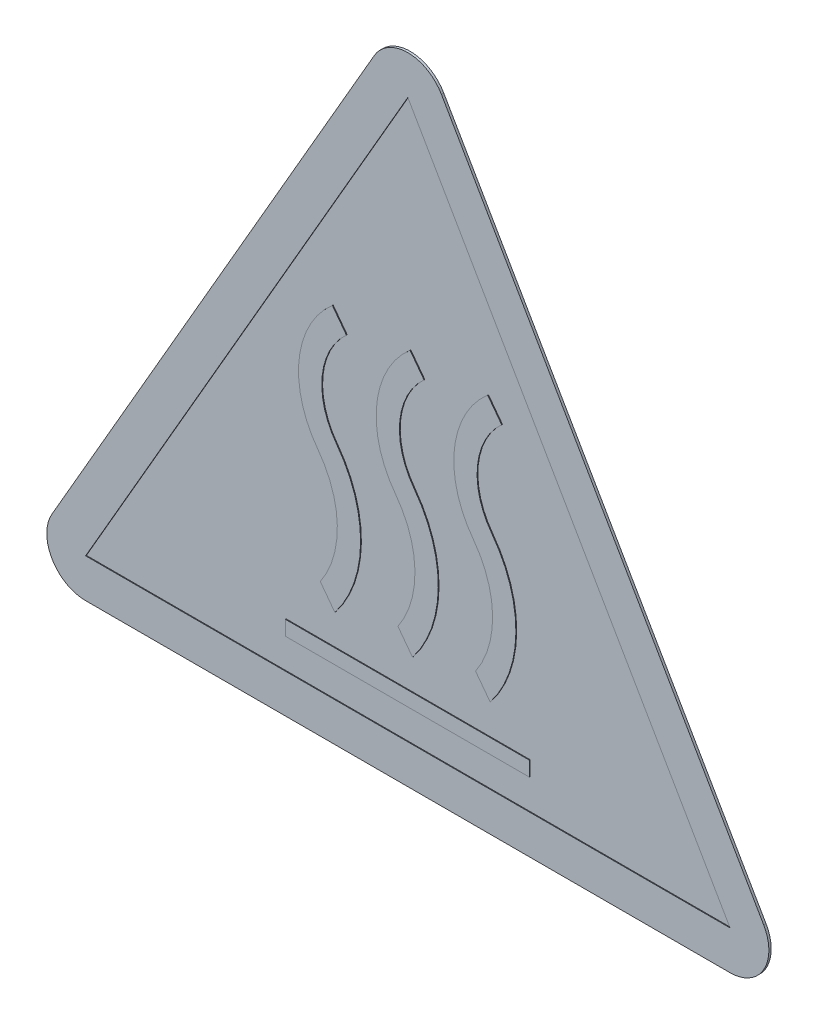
ISO-10303-21;
HEADER;
FILE_DESCRIPTION(('STEP AP214'),'2;1');
FILE_NAME('part.step','',(''),(''),'','','');
FILE_SCHEMA(('AUTOMOTIVE_DESIGN { 1 0 10303 214 1 1 1 1 }'));
ENDSEC;
DATA;
#1=APPLICATION_CONTEXT('core data for automotive mechanical design processes');
#2=APPLICATION_PROTOCOL_DEFINITION('international standard','automotive_design',2000,#1);
#3=PRODUCT_CONTEXT('',#1,'mechanical');
#4=PRODUCT('Part','Part','',(#3));
#5=PRODUCT_RELATED_PRODUCT_CATEGORY('part','',(#4));
#6=PRODUCT_DEFINITION_FORMATION('','',#4);
#7=PRODUCT_DEFINITION_CONTEXT('part definition',#1,'design');
#8=PRODUCT_DEFINITION('design','',#6,#7);
#9=PRODUCT_DEFINITION_SHAPE('','',#8);
#10=(LENGTH_UNIT() NAMED_UNIT(*) SI_UNIT(.MILLI.,.METRE.));
#11=(NAMED_UNIT(*) PLANE_ANGLE_UNIT() SI_UNIT($,.RADIAN.));
#12=(NAMED_UNIT(*) SI_UNIT($,.STERADIAN.) SOLID_ANGLE_UNIT());
#13=UNCERTAINTY_MEASURE_WITH_UNIT(LENGTH_MEASURE(1.E-05),#10,'distance_accuracy_value','');
#14=(GEOMETRIC_REPRESENTATION_CONTEXT(3) GLOBAL_UNCERTAINTY_ASSIGNED_CONTEXT((#13)) GLOBAL_UNIT_ASSIGNED_CONTEXT((#10,
#11,#12)) REPRESENTATION_CONTEXT('',''));
#15=CARTESIAN_POINT('',(0.,0.,0.));
#16=DIRECTION('',(0.,0.,1.));
#17=DIRECTION('',(1.,0.,0.));
#18=AXIS2_PLACEMENT_3D('',#15,#16,#17);
#19=CARTESIAN_POINT('',(0.,76.8801085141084,0.300000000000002));
#20=DIRECTION('',(0.,0.,-1.));
#21=DIRECTION('',(-1.,0.,0.));
#22=AXIS2_PLACEMENT_3D('',#19,#20,#21);
#23=CYLINDRICAL_SURFACE('',#22,5.);
#24=CARTESIAN_POINT('',(0.,76.8801085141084,0.));
#25=DIRECTION('',(0.,0.,1.));
#26=DIRECTION('',(1.,0.,0.));
#27=AXIS2_PLACEMENT_3D('',#24,#25,#26);
#28=CIRCLE('',#27,5.);
#29=CARTESIAN_POINT('',(4.33012701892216,79.3801085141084,0.));
#30=VERTEX_POINT('',#29);
#31=CARTESIAN_POINT('',(-4.33012701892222,79.3801085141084,0.));
#32=VERTEX_POINT('',#31);
#33=EDGE_CURVE('E522',#30,#32,#28,.T.);
#34=ORIENTED_EDGE('',*,*,#33,.T.);
#35=DIRECTION('',(0.,0.,-1.));
#36=VECTOR('',#35,1.);
#37=CARTESIAN_POINT('',(-4.33012701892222,79.3801085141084,0.300000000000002));
#38=LINE('',#37,#36);
#39=CARTESIAN_POINT('',(-4.33012701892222,79.3801085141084,0.300000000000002));
#40=VERTEX_POINT('',#39);
#41=EDGE_CURVE('E11',#40,#32,#38,.T.);
#42=ORIENTED_EDGE('',*,*,#41,.F.);
#43=CARTESIAN_POINT('',(0.,76.8801085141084,0.300000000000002));
#44=DIRECTION('',(0.,0.,1.));
#45=DIRECTION('',(1.,0.,0.));
#46=AXIS2_PLACEMENT_3D('',#43,#44,#45);
#47=CIRCLE('',#46,5.);
#48=CARTESIAN_POINT('',(4.33012701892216,79.3801085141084,0.300000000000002));
#49=VERTEX_POINT('',#48);
#50=EDGE_CURVE('E546',#49,#40,#47,.T.);
#51=ORIENTED_EDGE('',*,*,#50,.F.);
#52=DIRECTION('',(0.,0.,-1.));
#53=VECTOR('',#52,1.);
#54=CARTESIAN_POINT('',(4.33012701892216,79.3801085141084,0.300000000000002));
#55=LINE('',#54,#53);
#56=EDGE_CURVE('E564',#49,#30,#55,.T.);
#57=ORIENTED_EDGE('',*,*,#56,.T.);
#58=EDGE_LOOP('',(#34,#42,#51,#57));
#59=FACE_BOUND('',#58,.T.);
#60=ADVANCED_FACE('F40',(#59),#23,.T.);
#61=CARTESIAN_POINT('',(-4.33012701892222,79.3801085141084,0.300000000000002));
#62=DIRECTION('',(0.866025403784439,-0.5,0.));
#63=DIRECTION('',(0.5,0.866025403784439,0.));
#64=AXIS2_PLACEMENT_3D('',#61,#62,#63);
#65=PLANE('',#64);
#66=DIRECTION('',(-0.5,-0.866025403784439,0.));
#67=VECTOR('',#66,1.);
#68=CARTESIAN_POINT('',(-4.33012701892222,79.3801085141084,0.));
#69=LINE('',#68,#67);
#70=CARTESIAN_POINT('',(-45.8301270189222,7.50000000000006,0.));
#71=VERTEX_POINT('',#70);
#72=EDGE_CURVE('E531',#32,#71,#69,.T.);
#73=ORIENTED_EDGE('',*,*,#72,.T.);
#74=DIRECTION('',(0.,0.,-1.));
#75=VECTOR('',#74,1.);
#76=CARTESIAN_POINT('',(-45.8301270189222,7.50000000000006,0.300000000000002));
#77=LINE('',#76,#75);
#78=CARTESIAN_POINT('',(-45.8301270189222,7.50000000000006,0.300000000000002));
#79=VERTEX_POINT('',#78);
#80=EDGE_CURVE('E48',#79,#71,#77,.T.);
#81=ORIENTED_EDGE('',*,*,#80,.F.);
#82=DIRECTION('',(-0.5,-0.866025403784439,0.));
#83=VECTOR('',#82,1.);
#84=CARTESIAN_POINT('',(-4.33012701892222,79.3801085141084,0.300000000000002));
#85=LINE('',#84,#83);
#86=EDGE_CURVE('E550',#40,#79,#85,.T.);
#87=ORIENTED_EDGE('',*,*,#86,.F.);
#88=ORIENTED_EDGE('',*,*,#41,.T.);
#89=EDGE_LOOP('',(#73,#81,#87,#88));
#90=FACE_BOUND('',#89,.T.);
#91=ADVANCED_FACE('F608',(#90),#65,.F.);
#92=CARTESIAN_POINT('',(-41.5,5.00000000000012,0.300000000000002));
#93=DIRECTION('',(0.,0.,-1.));
#94=DIRECTION('',(-1.,0.,0.));
#95=AXIS2_PLACEMENT_3D('',#92,#93,#94);
#96=CYLINDRICAL_SURFACE('',#95,5.);
#97=CARTESIAN_POINT('',(-41.5,5.00000000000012,0.));
#98=DIRECTION('',(0.,0.,1.));
#99=DIRECTION('',(-1.,0.,0.));
#100=AXIS2_PLACEMENT_3D('',#97,#98,#99);
#101=CIRCLE('',#100,5.);
#102=CARTESIAN_POINT('',(-41.5,0.,0.));
#103=VERTEX_POINT('',#102);
#104=EDGE_CURVE('E534',#71,#103,#101,.T.);
#105=ORIENTED_EDGE('',*,*,#104,.T.);
#106=DIRECTION('',(0.,0.,-1.));
#107=VECTOR('',#106,1.);
#108=CARTESIAN_POINT('',(-41.5,0.,0.300000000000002));
#109=LINE('',#108,#107);
#110=CARTESIAN_POINT('',(-41.5,0.,0.300000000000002));
#111=VERTEX_POINT('',#110);
#112=EDGE_CURVE('E576',#111,#103,#109,.T.);
#113=ORIENTED_EDGE('',*,*,#112,.F.);
#114=CARTESIAN_POINT('',(-41.5,5.00000000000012,0.300000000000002));
#115=DIRECTION('',(0.,0.,1.));
#116=DIRECTION('',(-1.,0.,0.));
#117=AXIS2_PLACEMENT_3D('',#114,#115,#116);
#118=CIRCLE('',#117,5.);
#119=EDGE_CURVE('E553',#79,#111,#118,.T.);
#120=ORIENTED_EDGE('',*,*,#119,.F.);
#121=ORIENTED_EDGE('',*,*,#80,.T.);
#122=EDGE_LOOP('',(#105,#113,#120,#121));
#123=FACE_BOUND('',#122,.T.);
#124=ADVANCED_FACE('F585',(#123),#96,.T.);
#125=CARTESIAN_POINT('',(-41.5,0.,0.300000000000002));
#126=DIRECTION('',(0.,1.,0.));
#127=DIRECTION('',(-1.,0.,0.));
#128=AXIS2_PLACEMENT_3D('',#125,#126,#127);
#129=PLANE('',#128);
#130=DIRECTION('',(1.,0.,0.));
#131=VECTOR('',#130,1.);
#132=CARTESIAN_POINT('',(-41.5,0.,0.));
#133=LINE('',#132,#131);
#134=CARTESIAN_POINT('',(41.5,0.,0.));
#135=VERTEX_POINT('',#134);
#136=EDGE_CURVE('E537',#103,#135,#133,.T.);
#137=ORIENTED_EDGE('',*,*,#136,.T.);
#138=DIRECTION('',(0.,0.,-1.));
#139=VECTOR('',#138,1.);
#140=CARTESIAN_POINT('',(41.5,0.,0.300000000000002));
#141=LINE('',#140,#139);
#142=CARTESIAN_POINT('',(41.5,0.,0.300000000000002));
#143=VERTEX_POINT('',#142);
#144=EDGE_CURVE('E572',#143,#135,#141,.T.);
#145=ORIENTED_EDGE('',*,*,#144,.F.);
#146=DIRECTION('',(1.,0.,0.));
#147=VECTOR('',#146,1.);
#148=CARTESIAN_POINT('',(-41.5,0.,0.300000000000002));
#149=LINE('',#148,#147);
#150=EDGE_CURVE('E556',#111,#143,#149,.T.);
#151=ORIENTED_EDGE('',*,*,#150,.F.);
#152=ORIENTED_EDGE('',*,*,#112,.T.);
#153=EDGE_LOOP('',(#137,#145,#151,#152));
#154=FACE_BOUND('',#153,.T.);
#155=ADVANCED_FACE('F596',(#154),#129,.F.);
#156=CARTESIAN_POINT('',(41.5,5.00000000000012,0.300000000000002));
#157=DIRECTION('',(0.,0.,-1.));
#158=DIRECTION('',(-1.,0.,0.));
#159=AXIS2_PLACEMENT_3D('',#156,#157,#158);
#160=CYLINDRICAL_SURFACE('',#159,5.);
#161=CARTESIAN_POINT('',(41.5,5.00000000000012,0.));
#162=DIRECTION('',(0.,0.,1.));
#163=DIRECTION('',(1.,0.,0.));
#164=AXIS2_PLACEMENT_3D('',#161,#162,#163);
#165=CIRCLE('',#164,5.);
#166=CARTESIAN_POINT('',(45.8301270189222,7.50000000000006,0.));
#167=VERTEX_POINT('',#166);
#168=EDGE_CURVE('E540',#135,#167,#165,.T.);
#169=ORIENTED_EDGE('',*,*,#168,.T.);
#170=DIRECTION('',(0.,0.,-1.));
#171=VECTOR('',#170,1.);
#172=CARTESIAN_POINT('',(45.8301270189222,7.50000000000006,0.300000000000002));
#173=LINE('',#172,#171);
#174=CARTESIAN_POINT('',(45.8301270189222,7.50000000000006,0.300000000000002));
#175=VERTEX_POINT('',#174);
#176=EDGE_CURVE('E568',#175,#167,#173,.T.);
#177=ORIENTED_EDGE('',*,*,#176,.F.);
#178=CARTESIAN_POINT('',(41.5,5.00000000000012,0.300000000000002));
#179=DIRECTION('',(0.,0.,1.));
#180=DIRECTION('',(1.,0.,0.));
#181=AXIS2_PLACEMENT_3D('',#178,#179,#180);
#182=CIRCLE('',#181,5.);
#183=EDGE_CURVE('E558',#143,#175,#182,.T.);
#184=ORIENTED_EDGE('',*,*,#183,.F.);
#185=ORIENTED_EDGE('',*,*,#144,.T.);
#186=EDGE_LOOP('',(#169,#177,#184,#185));
#187=FACE_BOUND('',#186,.T.);
#188=ADVANCED_FACE('F600',(#187),#160,.T.);
#189=CARTESIAN_POINT('',(45.8301270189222,7.50000000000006,0.300000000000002));
#190=DIRECTION('',(-0.866025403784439,-0.5,0.));
#191=DIRECTION('',(0.5,-0.866025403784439,0.));
#192=AXIS2_PLACEMENT_3D('',#189,#190,#191);
#193=PLANE('',#192);
#194=DIRECTION('',(-0.5,0.866025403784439,0.));
#195=VECTOR('',#194,1.);
#196=CARTESIAN_POINT('',(45.8301270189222,7.50000000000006,0.));
#197=LINE('',#196,#195);
#198=EDGE_CURVE('E543',#167,#30,#197,.T.);
#199=ORIENTED_EDGE('',*,*,#198,.T.);
#200=ORIENTED_EDGE('',*,*,#56,.F.);
#201=DIRECTION('',(-0.5,0.866025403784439,0.));
#202=VECTOR('',#201,1.);
#203=CARTESIAN_POINT('',(45.8301270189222,7.50000000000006,0.300000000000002));
#204=LINE('',#203,#202);
#205=EDGE_CURVE('E561',#175,#49,#204,.T.);
#206=ORIENTED_EDGE('',*,*,#205,.F.);
#207=ORIENTED_EDGE('',*,*,#176,.T.);
#208=EDGE_LOOP('',(#199,#200,#206,#207));
#209=FACE_BOUND('',#208,.T.);
#210=ADVANCED_FACE('F611',(#209),#193,.F.);
#211=CARTESIAN_POINT('',(0.,76.8801085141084,0.300000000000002));
#212=DIRECTION('',(0.,0.,1.));
#213=DIRECTION('',(1.,0.,0.));
#214=AXIS2_PLACEMENT_3D('',#211,#212,#213);
#215=PLANE('',#214);
#216=DIRECTION('',(-0.5,0.866025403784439,0.));
#217=VECTOR('',#216,1.);
#218=CARTESIAN_POINT('',(41.5,5.00000000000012,0.300000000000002));
#219=LINE('',#218,#217);
#220=CARTESIAN_POINT('',(41.5,5.00000000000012,0.300000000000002));
#221=VERTEX_POINT('',#220);
#222=CARTESIAN_POINT('',(0.,76.8801085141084,0.300000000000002));
#223=VERTEX_POINT('',#222);
#224=EDGE_CURVE('E55',#221,#223,#219,.T.);
#225=ORIENTED_EDGE('',*,*,#224,.F.);
#226=DIRECTION('',(1.,0.,0.));
#227=VECTOR('',#226,1.);
#228=CARTESIAN_POINT('',(-41.5,5.00000000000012,0.300000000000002));
#229=LINE('',#228,#227);
#230=CARTESIAN_POINT('',(-41.5,5.00000000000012,0.300000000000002));
#231=VERTEX_POINT('',#230);
#232=EDGE_CURVE('E502',#231,#221,#229,.T.);
#233=ORIENTED_EDGE('',*,*,#232,.F.);
#234=DIRECTION('',(-0.5,-0.866025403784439,0.));
#235=VECTOR('',#234,1.);
#236=CARTESIAN_POINT('',(0.,76.8801085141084,0.300000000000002));
#237=LINE('',#236,#235);
#238=EDGE_CURVE('E498',#223,#231,#237,.T.);
#239=ORIENTED_EDGE('',*,*,#238,.F.);
#240=EDGE_LOOP('',(#225,#233,#239));
#241=FACE_BOUND('',#240,.T.);
#242=ORIENTED_EDGE('',*,*,#50,.T.);
#243=ORIENTED_EDGE('',*,*,#86,.T.);
#244=ORIENTED_EDGE('',*,*,#119,.T.);
#245=ORIENTED_EDGE('',*,*,#150,.T.);
#246=ORIENTED_EDGE('',*,*,#183,.T.);
#247=ORIENTED_EDGE('',*,*,#205,.T.);
#248=EDGE_LOOP('',(#242,#243,#244,#245,#246,#247));
#249=FACE_BOUND('',#248,.T.);
#250=ADVANCED_FACE('F604',(#241,#249),#215,.T.);
#251=CARTESIAN_POINT('',(0.,76.8801085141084,0.));
#252=DIRECTION('',(0.,0.,1.));
#253=DIRECTION('',(1.,0.,0.));
#254=AXIS2_PLACEMENT_3D('',#251,#252,#253);
#255=PLANE('',#254);
#256=ORIENTED_EDGE('',*,*,#33,.F.);
#257=ORIENTED_EDGE('',*,*,#198,.F.);
#258=ORIENTED_EDGE('',*,*,#168,.F.);
#259=ORIENTED_EDGE('',*,*,#136,.F.);
#260=ORIENTED_EDGE('',*,*,#104,.F.);
#261=ORIENTED_EDGE('',*,*,#72,.F.);
#262=EDGE_LOOP('',(#256,#257,#258,#259,#260,#261));
#263=FACE_BOUND('',#262,.T.);
#264=ADVANCED_FACE('F591',(#263),#255,.F.);
#265=CARTESIAN_POINT('',(41.5,5.00000000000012,0.199999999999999));
#266=DIRECTION('',(0.866025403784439,0.5,0.));
#267=DIRECTION('',(-0.5,0.866025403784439,0.));
#268=AXIS2_PLACEMENT_3D('',#265,#266,#267);
#269=PLANE('',#268);
#270=ORIENTED_EDGE('',*,*,#224,.T.);
#271=DIRECTION('',(0.,0.,1.));
#272=VECTOR('',#271,1.);
#273=CARTESIAN_POINT('',(0.,76.8801085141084,0.199999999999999));
#274=LINE('',#273,#272);
#275=CARTESIAN_POINT('',(0.,76.8801085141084,0.199999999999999));
#276=VERTEX_POINT('',#275);
#277=EDGE_CURVE('E518',#276,#223,#274,.T.);
#278=ORIENTED_EDGE('',*,*,#277,.F.);
#279=DIRECTION('',(-0.5,0.866025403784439,0.));
#280=VECTOR('',#279,1.);
#281=CARTESIAN_POINT('',(41.5,5.00000000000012,0.199999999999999));
#282=LINE('',#281,#280);
#283=CARTESIAN_POINT('',(41.5,5.00000000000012,0.199999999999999));
#284=VERTEX_POINT('',#283);
#285=EDGE_CURVE('E506',#284,#276,#282,.T.);
#286=ORIENTED_EDGE('',*,*,#285,.F.);
#287=DIRECTION('',(0.,0.,1.));
#288=VECTOR('',#287,1.);
#289=CARTESIAN_POINT('',(41.5,5.00000000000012,0.199999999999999));
#290=LINE('',#289,#288);
#291=EDGE_CURVE('E519',#284,#221,#290,.T.);
#292=ORIENTED_EDGE('',*,*,#291,.T.);
#293=EDGE_LOOP('',(#270,#278,#286,#292));
#294=FACE_BOUND('',#293,.T.);
#295=ADVANCED_FACE('F656',(#294),#269,.F.);
#296=CARTESIAN_POINT('',(-41.5,5.00000000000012,0.199999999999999));
#297=DIRECTION('',(0.,-1.,0.));
#298=DIRECTION('',(0.,0.,-1.));
#299=AXIS2_PLACEMENT_3D('',#296,#297,#298);
#300=PLANE('',#299);
#301=ORIENTED_EDGE('',*,*,#232,.T.);
#302=ORIENTED_EDGE('',*,*,#291,.F.);
#303=DIRECTION('',(1.,0.,0.));
#304=VECTOR('',#303,1.);
#305=CARTESIAN_POINT('',(-41.5,5.00000000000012,0.199999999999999));
#306=LINE('',#305,#304);
#307=CARTESIAN_POINT('',(-41.5,5.00000000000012,0.199999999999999));
#308=VERTEX_POINT('',#307);
#309=EDGE_CURVE('E514',#308,#284,#306,.T.);
#310=ORIENTED_EDGE('',*,*,#309,.F.);
#311=DIRECTION('',(0.,0.,1.));
#312=VECTOR('',#311,1.);
#313=CARTESIAN_POINT('',(-41.5,5.00000000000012,0.199999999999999));
#314=LINE('',#313,#312);
#315=EDGE_CURVE('E523',#308,#231,#314,.T.);
#316=ORIENTED_EDGE('',*,*,#315,.T.);
#317=EDGE_LOOP('',(#301,#302,#310,#316));
#318=FACE_BOUND('',#317,.T.);
#319=ADVANCED_FACE('F664',(#318),#300,.F.);
#320=CARTESIAN_POINT('',(0.,76.8801085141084,0.199999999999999));
#321=DIRECTION('',(-0.866025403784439,0.5,0.));
#322=DIRECTION('',(-0.5,-0.866025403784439,0.));
#323=AXIS2_PLACEMENT_3D('',#320,#321,#322);
#324=PLANE('',#323);
#325=ORIENTED_EDGE('',*,*,#238,.T.);
#326=ORIENTED_EDGE('',*,*,#315,.F.);
#327=DIRECTION('',(-0.5,-0.866025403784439,0.));
#328=VECTOR('',#327,1.);
#329=CARTESIAN_POINT('',(0.,76.8801085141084,0.199999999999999));
#330=LINE('',#329,#328);
#331=EDGE_CURVE('E510',#276,#308,#330,.T.);
#332=ORIENTED_EDGE('',*,*,#331,.F.);
#333=ORIENTED_EDGE('',*,*,#277,.T.);
#334=EDGE_LOOP('',(#325,#326,#332,#333));
#335=FACE_BOUND('',#334,.T.);
#336=ADVANCED_FACE('F672',(#335),#324,.F.);
#337=CARTESIAN_POINT('',(0.,76.8801085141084,0.199999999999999));
#338=DIRECTION('',(0.,0.,1.));
#339=DIRECTION('',(1.,0.,0.));
#340=AXIS2_PLACEMENT_3D('',#337,#338,#339);
#341=PLANE('',#340);
#342=CARTESIAN_POINT('',(-1.58108827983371,24.328772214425,0.199999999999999));
#343=DIRECTION('',(0.,0.,1.));
#344=DIRECTION('',(1.,0.,0.));
#345=AXIS2_PLACEMENT_3D('',#342,#343,#344);
#346=CIRCLE('',#345,15.5);
#347=CARTESIAN_POINT('',(10.60237841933,14.7468549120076,0.199999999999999));
#348=VERTEX_POINT('',#347);
#349=CARTESIAN_POINT('',(10.8189117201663,33.6287722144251,0.199999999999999));
#350=VERTEX_POINT('',#349);
#351=EDGE_CURVE('E304',#348,#350,#346,.T.);
#352=ORIENTED_EDGE('',*,*,#351,.F.);
#353=DIRECTION('',(0.6,-0.8,0.));
#354=VECTOR('',#353,1.);
#355=CARTESIAN_POINT('',(8.72312323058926,17.2525284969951,0.199999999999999));
#356=LINE('',#355,#354);
#357=CARTESIAN_POINT('',(8.72312323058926,17.2525284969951,0.199999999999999));
#358=VERTEX_POINT('',#357);
#359=EDGE_CURVE('E300',#358,#348,#356,.T.);
#360=ORIENTED_EDGE('',*,*,#359,.F.);
#361=CARTESIAN_POINT('',(-1.58108827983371,24.328772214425,0.199999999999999));
#362=DIRECTION('',(0.,0.,-1.));
#363=DIRECTION('',(1.,0.,0.));
#364=AXIS2_PLACEMENT_3D('',#361,#362,#363);
#365=CIRCLE('',#364,12.5);
#366=CARTESIAN_POINT('',(8.41891172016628,31.828772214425,0.199999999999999));
#367=VERTEX_POINT('',#366);
#368=EDGE_CURVE('E297',#367,#358,#365,.T.);
#369=ORIENTED_EDGE('',*,*,#368,.F.);
#370=CARTESIAN_POINT('',(18.4189117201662,39.3287722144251,0.199999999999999));
#371=DIRECTION('',(0.,0.,1.));
#372=DIRECTION('',(1.,0.,0.));
#373=AXIS2_PLACEMENT_3D('',#370,#371,#372);
#374=CIRCLE('',#373,12.5);
#375=CARTESIAN_POINT('',(10.2819801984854,48.8177313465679,0.199999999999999));
#376=VERTEX_POINT('',#375);
#377=EDGE_CURVE('E250',#376,#367,#374,.T.);
#378=ORIENTED_EDGE('',*,*,#377,.F.);
#379=DIRECTION('',(-0.600000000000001,0.799999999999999,0.));
#380=VECTOR('',#379,1.);
#381=CARTESIAN_POINT('',(12.087050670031,46.4109707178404,0.199999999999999));
#382=LINE('',#381,#380);
#383=CARTESIAN_POINT('',(12.087050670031,46.4109707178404,0.199999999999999));
#384=VERTEX_POINT('',#383);
#385=EDGE_CURVE('E291',#384,#376,#382,.T.);
#386=ORIENTED_EDGE('',*,*,#385,.F.);
#387=CARTESIAN_POINT('',(18.4189117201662,39.3287722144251,0.199999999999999));
#388=DIRECTION('',(0.,0.,-1.));
#389=DIRECTION('',(1.,0.,0.));
#390=AXIS2_PLACEMENT_3D('',#387,#388,#389);
#391=CIRCLE('',#390,9.5);
#392=EDGE_CURVE('E287',#350,#384,#391,.T.);
#393=ORIENTED_EDGE('',*,*,#392,.F.);
#394=EDGE_LOOP('',(#352,#360,#369,#378,#386,#393));
#395=FACE_BOUND('',#394,.T.);
#396=CARTESIAN_POINT('',(-11.5810882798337,24.3287722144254,0.199999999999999));
#397=DIRECTION('',(0.,0.,1.));
#398=DIRECTION('',(1.,0.,0.));
#399=AXIS2_PLACEMENT_3D('',#396,#397,#398);
#400=CIRCLE('',#399,15.5);
#401=CARTESIAN_POINT('',(0.602378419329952,14.7468549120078,0.199999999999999));
#402=VERTEX_POINT('',#401);
#403=CARTESIAN_POINT('',(0.818911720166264,33.6287722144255,0.199999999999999));
#404=VERTEX_POINT('',#403);
#405=EDGE_CURVE('E364',#402,#404,#400,.T.);
#406=ORIENTED_EDGE('',*,*,#405,.F.);
#407=DIRECTION('',(0.6,-0.8,0.));
#408=VECTOR('',#407,1.);
#409=CARTESIAN_POINT('',(-1.27687676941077,17.2525284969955,0.199999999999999));
#410=LINE('',#409,#408);
#411=CARTESIAN_POINT('',(-1.27687676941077,17.2525284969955,0.199999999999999));
#412=VERTEX_POINT('',#411);
#413=EDGE_CURVE('E360',#412,#402,#410,.T.);
#414=ORIENTED_EDGE('',*,*,#413,.F.);
#415=CARTESIAN_POINT('',(-11.5810882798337,24.3287722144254,0.199999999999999));
#416=DIRECTION('',(0.,0.,-1.));
#417=DIRECTION('',(1.,0.,0.));
#418=AXIS2_PLACEMENT_3D('',#415,#416,#417);
#419=CIRCLE('',#418,12.5);
#420=CARTESIAN_POINT('',(-1.58108827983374,31.8287722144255,0.199999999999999));
#421=VERTEX_POINT('',#420);
#422=EDGE_CURVE('E356',#421,#412,#419,.T.);
#423=ORIENTED_EDGE('',*,*,#422,.F.);
#424=CARTESIAN_POINT('',(8.41891172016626,39.3287722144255,0.199999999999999));
#425=DIRECTION('',(0.,0.,1.));
#426=DIRECTION('',(1.,0.,0.));
#427=AXIS2_PLACEMENT_3D('',#424,#425,#426);
#428=CIRCLE('',#427,12.5);
#429=CARTESIAN_POINT('',(0.281980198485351,48.8177313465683,0.199999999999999));
#430=VERTEX_POINT('',#429);
#431=EDGE_CURVE('E352',#430,#421,#428,.T.);
#432=ORIENTED_EDGE('',*,*,#431,.F.);
#433=DIRECTION('',(-0.600000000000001,0.799999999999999,0.));
#434=VECTOR('',#433,1.);
#435=CARTESIAN_POINT('',(2.08705067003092,46.4109707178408,0.199999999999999));
#436=LINE('',#435,#434);
#437=CARTESIAN_POINT('',(2.08705067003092,46.4109707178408,0.199999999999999));
#438=VERTEX_POINT('',#437);
#439=EDGE_CURVE('E348',#438,#430,#436,.T.);
#440=ORIENTED_EDGE('',*,*,#439,.F.);
#441=CARTESIAN_POINT('',(8.41891172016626,39.3287722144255,0.199999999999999));
#442=DIRECTION('',(0.,0.,-1.));
#443=DIRECTION('',(1.,0.,0.));
#444=AXIS2_PLACEMENT_3D('',#441,#442,#443);
#445=CIRCLE('',#444,9.5);
#446=EDGE_CURVE('E344',#404,#438,#445,.T.);
#447=ORIENTED_EDGE('',*,*,#446,.F.);
#448=EDGE_LOOP('',(#406,#414,#423,#432,#440,#447));
#449=FACE_BOUND('',#448,.T.);
#450=CARTESIAN_POINT('',(-21.5810882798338,24.3287722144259,0.199999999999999));
#451=DIRECTION('',(0.,0.,1.));
#452=DIRECTION('',(1.,0.,0.));
#453=AXIS2_PLACEMENT_3D('',#450,#451,#452);
#454=CIRCLE('',#453,15.5);
#455=CARTESIAN_POINT('',(-9.39762158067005,14.7468549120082,0.199999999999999));
#456=VERTEX_POINT('',#455);
#457=CARTESIAN_POINT('',(-9.18108827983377,33.6287722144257,0.199999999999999));
#458=VERTEX_POINT('',#457);
#459=EDGE_CURVE('E431',#456,#458,#454,.T.);
#460=ORIENTED_EDGE('',*,*,#459,.F.);
#461=DIRECTION('',(0.6,-0.8,0.));
#462=VECTOR('',#461,1.);
#463=CARTESIAN_POINT('',(-11.2768767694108,17.252528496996,0.199999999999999));
#464=LINE('',#463,#462);
#465=CARTESIAN_POINT('',(-11.2768767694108,17.252528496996,0.199999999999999));
#466=VERTEX_POINT('',#465);
#467=EDGE_CURVE('E427',#466,#456,#464,.T.);
#468=ORIENTED_EDGE('',*,*,#467,.F.);
#469=CARTESIAN_POINT('',(-21.5810882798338,24.3287722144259,0.199999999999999));
#470=DIRECTION('',(0.,0.,-1.));
#471=DIRECTION('',(1.,0.,0.));
#472=AXIS2_PLACEMENT_3D('',#469,#470,#471);
#473=CIRCLE('',#472,12.5);
#474=CARTESIAN_POINT('',(-11.5810882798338,31.8287722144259,0.199999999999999));
#475=VERTEX_POINT('',#474);
#476=EDGE_CURVE('E423',#475,#466,#473,.T.);
#477=ORIENTED_EDGE('',*,*,#476,.F.);
#478=CARTESIAN_POINT('',(-1.58108827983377,39.3287722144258,0.199999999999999));
#479=DIRECTION('',(0.,0.,1.));
#480=DIRECTION('',(1.,0.,0.));
#481=AXIS2_PLACEMENT_3D('',#478,#479,#480);
#482=CIRCLE('',#481,12.5);
#483=CARTESIAN_POINT('',(-9.71801980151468,48.8177313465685,0.199999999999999));
#484=VERTEX_POINT('',#483);
#485=EDGE_CURVE('E419',#484,#475,#482,.T.);
#486=ORIENTED_EDGE('',*,*,#485,.F.);
#487=DIRECTION('',(-0.600000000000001,0.799999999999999,0.));
#488=VECTOR('',#487,1.);
#489=CARTESIAN_POINT('',(-7.91294932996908,46.4109707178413,0.199999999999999));
#490=LINE('',#489,#488);
#491=CARTESIAN_POINT('',(-7.91294932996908,46.4109707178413,0.199999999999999));
#492=VERTEX_POINT('',#491);
#493=EDGE_CURVE('E415',#492,#484,#490,.T.);
#494=ORIENTED_EDGE('',*,*,#493,.F.);
#495=CARTESIAN_POINT('',(-1.58108827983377,39.3287722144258,0.199999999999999));
#496=DIRECTION('',(0.,0.,-1.));
#497=DIRECTION('',(1.,0.,0.));
#498=AXIS2_PLACEMENT_3D('',#495,#496,#497);
#499=CIRCLE('',#498,9.5);
#500=EDGE_CURVE('E411',#458,#492,#499,.T.);
#501=ORIENTED_EDGE('',*,*,#500,.F.);
#502=EDGE_LOOP('',(#460,#468,#477,#486,#494,#501));
#503=FACE_BOUND('',#502,.T.);
#504=DIRECTION('',(-1.,0.,0.));
#505=VECTOR('',#504,1.);
#506=CARTESIAN_POINT('',(-15.7721950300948,10.7840616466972,0.199999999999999));
#507=LINE('',#506,#505);
#508=CARTESIAN_POINT('',(15.6611232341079,10.7840616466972,0.199999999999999));
#509=VERTEX_POINT('',#508);
#510=CARTESIAN_POINT('',(-15.7721950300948,10.7840616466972,0.199999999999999));
#511=VERTEX_POINT('',#510);
#512=EDGE_CURVE('E480',#509,#511,#507,.T.);
#513=ORIENTED_EDGE('',*,*,#512,.F.);
#514=DIRECTION('',(0.,1.,0.));
#515=VECTOR('',#514,1.);
#516=CARTESIAN_POINT('',(15.6611232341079,10.7840616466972,0.199999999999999));
#517=LINE('',#516,#515);
#518=CARTESIAN_POINT('',(15.6611232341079,8.89584111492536,0.199999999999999));
#519=VERTEX_POINT('',#518);
#520=EDGE_CURVE('E476',#519,#509,#517,.T.);
#521=ORIENTED_EDGE('',*,*,#520,.F.);
#522=DIRECTION('',(1.,0.,0.));
#523=VECTOR('',#522,1.);
#524=CARTESIAN_POINT('',(-15.7721950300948,8.89584111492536,0.199999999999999));
#525=LINE('',#524,#523);
#526=CARTESIAN_POINT('',(-15.7721950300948,8.89584111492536,0.199999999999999));
#527=VERTEX_POINT('',#526);
#528=EDGE_CURVE('E472',#527,#519,#525,.T.);
#529=ORIENTED_EDGE('',*,*,#528,.F.);
#530=DIRECTION('',(0.,-1.,0.));
#531=VECTOR('',#530,1.);
#532=CARTESIAN_POINT('',(-15.7721950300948,10.7840616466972,0.199999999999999));
#533=LINE('',#532,#531);
#534=EDGE_CURVE('E468',#511,#527,#533,.T.);
#535=ORIENTED_EDGE('',*,*,#534,.F.);
#536=EDGE_LOOP('',(#513,#521,#529,#535));
#537=FACE_BOUND('',#536,.T.);
#538=ORIENTED_EDGE('',*,*,#285,.T.);
#539=ORIENTED_EDGE('',*,*,#331,.T.);
#540=ORIENTED_EDGE('',*,*,#309,.T.);
#541=EDGE_LOOP('',(#538,#539,#540));
#542=FACE_BOUND('',#541,.T.);
#543=ADVANCED_FACE('F681',(#395,#449,#503,#537,#542),#341,.T.);
#544=CARTESIAN_POINT('',(-15.7721950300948,10.7840616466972,0.199999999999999));
#545=DIRECTION('',(-1.,0.,0.));
#546=DIRECTION('',(0.,0.,1.));
#547=AXIS2_PLACEMENT_3D('',#544,#545,#546);
#548=PLANE('',#547);
#549=DIRECTION('',(0.,-1.,0.));
#550=VECTOR('',#549,1.);
#551=CARTESIAN_POINT('',(-15.7721950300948,10.7840616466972,0.300000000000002));
#552=LINE('',#551,#550);
#553=CARTESIAN_POINT('',(-15.7721950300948,10.7840616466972,0.300000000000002));
#554=VERTEX_POINT('',#553);
#555=CARTESIAN_POINT('',(-15.7721950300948,8.89584111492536,0.300000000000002));
#556=VERTEX_POINT('',#555);
#557=EDGE_CURVE('E439',#554,#556,#552,.T.);
#558=ORIENTED_EDGE('',*,*,#557,.F.);
#559=DIRECTION('',(0.,0.,1.));
#560=VECTOR('',#559,1.);
#561=CARTESIAN_POINT('',(-15.7721950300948,10.7840616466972,0.199999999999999));
#562=LINE('',#561,#560);
#563=EDGE_CURVE('E485',#511,#554,#562,.T.);
#564=ORIENTED_EDGE('',*,*,#563,.F.);
#565=ORIENTED_EDGE('',*,*,#534,.T.);
#566=DIRECTION('',(0.,0.,1.));
#567=VECTOR('',#566,1.);
#568=CARTESIAN_POINT('',(-15.7721950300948,8.89584111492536,0.199999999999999));
#569=LINE('',#568,#567);
#570=EDGE_CURVE('E484',#527,#556,#569,.T.);
#571=ORIENTED_EDGE('',*,*,#570,.T.);
#572=EDGE_LOOP('',(#558,#564,#565,#571));
#573=FACE_BOUND('',#572,.T.);
#574=ADVANCED_FACE('F690',(#573),#548,.T.);
#575=CARTESIAN_POINT('',(-15.7721950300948,10.7840616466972,0.199999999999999));
#576=DIRECTION('',(0.,1.,0.));
#577=DIRECTION('',(0.,0.,1.));
#578=AXIS2_PLACEMENT_3D('',#575,#576,#577);
#579=PLANE('',#578);
#580=DIRECTION('',(-1.,0.,0.));
#581=VECTOR('',#580,1.);
#582=CARTESIAN_POINT('',(-15.7721950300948,10.7840616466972,0.300000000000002));
#583=LINE('',#582,#581);
#584=CARTESIAN_POINT('',(15.6611232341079,10.7840616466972,0.300000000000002));
#585=VERTEX_POINT('',#584);
#586=EDGE_CURVE('E464',#585,#554,#583,.T.);
#587=ORIENTED_EDGE('',*,*,#586,.F.);
#588=DIRECTION('',(0.,0.,1.));
#589=VECTOR('',#588,1.);
#590=CARTESIAN_POINT('',(15.6611232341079,10.7840616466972,0.199999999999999));
#591=LINE('',#590,#589);
#592=EDGE_CURVE('E488',#509,#585,#591,.T.);
#593=ORIENTED_EDGE('',*,*,#592,.F.);
#594=ORIENTED_EDGE('',*,*,#512,.T.);
#595=ORIENTED_EDGE('',*,*,#563,.T.);
#596=EDGE_LOOP('',(#587,#593,#594,#595));
#597=FACE_BOUND('',#596,.T.);
#598=ADVANCED_FACE('F699',(#597),#579,.T.);
#599=CARTESIAN_POINT('',(15.6611232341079,10.7840616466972,0.199999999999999));
#600=DIRECTION('',(1.,0.,0.));
#601=DIRECTION('',(0.,0.,-1.));
#602=AXIS2_PLACEMENT_3D('',#599,#600,#601);
#603=PLANE('',#602);
#604=DIRECTION('',(0.,1.,0.));
#605=VECTOR('',#604,1.);
#606=CARTESIAN_POINT('',(15.6611232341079,10.7840616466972,0.300000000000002));
#607=LINE('',#606,#605);
#608=CARTESIAN_POINT('',(15.6611232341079,8.89584111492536,0.300000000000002));
#609=VERTEX_POINT('',#608);
#610=EDGE_CURVE('E63',#609,#585,#607,.T.);
#611=ORIENTED_EDGE('',*,*,#610,.F.);
#612=DIRECTION('',(0.,0.,1.));
#613=VECTOR('',#612,1.);
#614=CARTESIAN_POINT('',(15.6611232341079,8.89584111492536,0.199999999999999));
#615=LINE('',#614,#613);
#616=EDGE_CURVE('E491',#519,#609,#615,.T.);
#617=ORIENTED_EDGE('',*,*,#616,.F.);
#618=ORIENTED_EDGE('',*,*,#520,.T.);
#619=ORIENTED_EDGE('',*,*,#592,.T.);
#620=EDGE_LOOP('',(#611,#617,#618,#619));
#621=FACE_BOUND('',#620,.T.);
#622=ADVANCED_FACE('F708',(#621),#603,.T.);
#623=CARTESIAN_POINT('',(-15.7721950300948,8.89584111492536,0.199999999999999));
#624=DIRECTION('',(0.,-1.,0.));
#625=DIRECTION('',(0.,0.,-1.));
#626=AXIS2_PLACEMENT_3D('',#623,#624,#625);
#627=PLANE('',#626);
#628=DIRECTION('',(1.,0.,0.));
#629=VECTOR('',#628,1.);
#630=CARTESIAN_POINT('',(-15.7721950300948,8.89584111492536,0.300000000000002));
#631=LINE('',#630,#629);
#632=EDGE_CURVE('E458',#556,#609,#631,.T.);
#633=ORIENTED_EDGE('',*,*,#632,.F.);
#634=ORIENTED_EDGE('',*,*,#570,.F.);
#635=ORIENTED_EDGE('',*,*,#528,.T.);
#636=ORIENTED_EDGE('',*,*,#616,.T.);
#637=EDGE_LOOP('',(#633,#634,#635,#636));
#638=FACE_BOUND('',#637,.T.);
#639=ADVANCED_FACE('F717',(#638),#627,.T.);
#640=CARTESIAN_POINT('',(-1.58108827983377,39.3287722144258,0.199999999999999));
#641=DIRECTION('',(0.,0.,1.));
#642=DIRECTION('',(1.,0.,0.));
#643=AXIS2_PLACEMENT_3D('',#640,#641,#642);
#644=CYLINDRICAL_SURFACE('',#643,9.5);
#645=CARTESIAN_POINT('',(-1.58108827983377,39.3287722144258,0.300000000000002));
#646=DIRECTION('',(0.,0.,-1.));
#647=DIRECTION('',(1.,0.,0.));
#648=AXIS2_PLACEMENT_3D('',#645,#646,#647);
#649=CIRCLE('',#648,9.5);
#650=CARTESIAN_POINT('',(-9.18108827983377,33.6287722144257,0.300000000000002));
#651=VERTEX_POINT('',#650);
#652=CARTESIAN_POINT('',(-7.91294932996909,46.4109707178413,0.300000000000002));
#653=VERTEX_POINT('',#652);
#654=EDGE_CURVE('E372',#651,#653,#649,.T.);
#655=ORIENTED_EDGE('',*,*,#654,.F.);
#656=DIRECTION('',(0.,0.,1.));
#657=VECTOR('',#656,1.);
#658=CARTESIAN_POINT('',(-9.18108827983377,33.6287722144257,0.199999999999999));
#659=LINE('',#658,#657);
#660=EDGE_CURVE('E436',#458,#651,#659,.T.);
#661=ORIENTED_EDGE('',*,*,#660,.F.);
#662=ORIENTED_EDGE('',*,*,#500,.T.);
#663=DIRECTION('',(0.,0.,1.));
#664=VECTOR('',#663,1.);
#665=CARTESIAN_POINT('',(-7.91294932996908,46.4109707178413,0.199999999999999));
#666=LINE('',#665,#664);
#667=EDGE_CURVE('E435',#492,#653,#666,.T.);
#668=ORIENTED_EDGE('',*,*,#667,.T.);
#669=EDGE_LOOP('',(#655,#661,#662,#668));
#670=FACE_BOUND('',#669,.T.);
#671=ADVANCED_FACE('F725',(#670),#644,.F.);
#672=CARTESIAN_POINT('',(-21.5810882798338,24.3287722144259,0.199999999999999));
#673=DIRECTION('',(0.,0.,1.));
#674=DIRECTION('',(1.,0.,0.));
#675=AXIS2_PLACEMENT_3D('',#672,#673,#674);
#676=CYLINDRICAL_SURFACE('',#675,15.5);
#677=CARTESIAN_POINT('',(-21.5810882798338,24.3287722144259,0.300000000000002));
#678=DIRECTION('',(0.,0.,1.));
#679=DIRECTION('',(1.,0.,0.));
#680=AXIS2_PLACEMENT_3D('',#677,#678,#679);
#681=CIRCLE('',#680,15.5);
#682=CARTESIAN_POINT('',(-9.39762158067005,14.7468549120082,0.300000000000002));
#683=VERTEX_POINT('',#682);
#684=EDGE_CURVE('E407',#683,#651,#681,.T.);
#685=ORIENTED_EDGE('',*,*,#684,.F.);
#686=DIRECTION('',(0.,0.,1.));
#687=VECTOR('',#686,1.);
#688=CARTESIAN_POINT('',(-9.39762158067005,14.7468549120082,0.199999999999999));
#689=LINE('',#688,#687);
#690=EDGE_CURVE('E440',#456,#683,#689,.T.);
#691=ORIENTED_EDGE('',*,*,#690,.F.);
#692=ORIENTED_EDGE('',*,*,#459,.T.);
#693=ORIENTED_EDGE('',*,*,#660,.T.);
#694=EDGE_LOOP('',(#685,#691,#692,#693));
#695=FACE_BOUND('',#694,.T.);
#696=ADVANCED_FACE('F734',(#695),#676,.T.);
#697=CARTESIAN_POINT('',(-11.2768767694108,17.252528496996,0.199999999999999));
#698=DIRECTION('',(-0.8,-0.6,0.));
#699=DIRECTION('',(0.6,-0.8,0.));
#700=AXIS2_PLACEMENT_3D('',#697,#698,#699);
#701=PLANE('',#700);
#702=DIRECTION('',(0.6,-0.8,0.));
#703=VECTOR('',#702,1.);
#704=CARTESIAN_POINT('',(-11.2768767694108,17.252528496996,0.300000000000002));
#705=LINE('',#704,#703);
#706=CARTESIAN_POINT('',(-11.2768767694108,17.252528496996,0.300000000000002));
#707=VERTEX_POINT('',#706);
#708=EDGE_CURVE('E403',#707,#683,#705,.T.);
#709=ORIENTED_EDGE('',*,*,#708,.F.);
#710=DIRECTION('',(0.,0.,1.));
#711=VECTOR('',#710,1.);
#712=CARTESIAN_POINT('',(-11.2768767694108,17.252528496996,0.199999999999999));
#713=LINE('',#712,#711);
#714=EDGE_CURVE('E443',#466,#707,#713,.T.);
#715=ORIENTED_EDGE('',*,*,#714,.F.);
#716=ORIENTED_EDGE('',*,*,#467,.T.);
#717=ORIENTED_EDGE('',*,*,#690,.T.);
#718=EDGE_LOOP('',(#709,#715,#716,#717));
#719=FACE_BOUND('',#718,.T.);
#720=ADVANCED_FACE('F743',(#719),#701,.T.);
#721=CARTESIAN_POINT('',(-21.5810882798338,24.3287722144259,0.199999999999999));
#722=DIRECTION('',(0.,0.,1.));
#723=DIRECTION('',(1.,0.,0.));
#724=AXIS2_PLACEMENT_3D('',#721,#722,#723);
#725=CYLINDRICAL_SURFACE('',#724,12.5);
#726=CARTESIAN_POINT('',(-21.5810882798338,24.3287722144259,0.300000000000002));
#727=DIRECTION('',(0.,0.,-1.));
#728=DIRECTION('',(1.,0.,0.));
#729=AXIS2_PLACEMENT_3D('',#726,#727,#728);
#730=CIRCLE('',#729,12.5);
#731=CARTESIAN_POINT('',(-11.5810882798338,31.8287722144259,0.300000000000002));
#732=VERTEX_POINT('',#731);
#733=EDGE_CURVE('E399',#732,#707,#730,.T.);
#734=ORIENTED_EDGE('',*,*,#733,.F.);
#735=DIRECTION('',(0.,0.,1.));
#736=VECTOR('',#735,1.);
#737=CARTESIAN_POINT('',(-11.5810882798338,31.8287722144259,0.199999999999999));
#738=LINE('',#737,#736);
#739=EDGE_CURVE('E446',#475,#732,#738,.T.);
#740=ORIENTED_EDGE('',*,*,#739,.F.);
#741=ORIENTED_EDGE('',*,*,#476,.T.);
#742=ORIENTED_EDGE('',*,*,#714,.T.);
#743=EDGE_LOOP('',(#734,#740,#741,#742));
#744=FACE_BOUND('',#743,.T.);
#745=ADVANCED_FACE('F752',(#744),#725,.F.);
#746=CARTESIAN_POINT('',(-1.58108827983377,39.3287722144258,0.199999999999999));
#747=DIRECTION('',(0.,0.,1.));
#748=DIRECTION('',(1.,0.,0.));
#749=AXIS2_PLACEMENT_3D('',#746,#747,#748);
#750=CYLINDRICAL_SURFACE('',#749,12.5);
#751=CARTESIAN_POINT('',(-1.58108827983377,39.3287722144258,0.300000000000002));
#752=DIRECTION('',(0.,0.,1.));
#753=DIRECTION('',(1.,0.,0.));
#754=AXIS2_PLACEMENT_3D('',#751,#752,#753);
#755=CIRCLE('',#754,12.5);
#756=CARTESIAN_POINT('',(-9.71801980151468,48.8177313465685,0.300000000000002));
#757=VERTEX_POINT('',#756);
#758=EDGE_CURVE('E395',#757,#732,#755,.T.);
#759=ORIENTED_EDGE('',*,*,#758,.F.);
#760=DIRECTION('',(0.,0.,1.));
#761=VECTOR('',#760,1.);
#762=CARTESIAN_POINT('',(-9.71801980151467,48.8177313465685,0.199999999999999));
#763=LINE('',#762,#761);
#764=EDGE_CURVE('E449',#484,#757,#763,.T.);
#765=ORIENTED_EDGE('',*,*,#764,.F.);
#766=ORIENTED_EDGE('',*,*,#485,.T.);
#767=ORIENTED_EDGE('',*,*,#739,.T.);
#768=EDGE_LOOP('',(#759,#765,#766,#767));
#769=FACE_BOUND('',#768,.T.);
#770=ADVANCED_FACE('F761',(#769),#750,.T.);
#771=CARTESIAN_POINT('',(-7.91294932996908,46.4109707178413,0.199999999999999));
#772=DIRECTION('',(0.799999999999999,0.600000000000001,0.));
#773=DIRECTION('',(-0.600000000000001,0.799999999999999,0.));
#774=AXIS2_PLACEMENT_3D('',#771,#772,#773);
#775=PLANE('',#774);
#776=DIRECTION('',(-0.600000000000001,0.799999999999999,0.));
#777=VECTOR('',#776,1.);
#778=CARTESIAN_POINT('',(-7.91294932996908,46.4109707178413,0.300000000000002));
#779=LINE('',#778,#777);
#780=EDGE_CURVE('E391',#653,#757,#779,.T.);
#781=ORIENTED_EDGE('',*,*,#780,.F.);
#782=ORIENTED_EDGE('',*,*,#667,.F.);
#783=ORIENTED_EDGE('',*,*,#493,.T.);
#784=ORIENTED_EDGE('',*,*,#764,.T.);
#785=EDGE_LOOP('',(#781,#782,#783,#784));
#786=FACE_BOUND('',#785,.T.);
#787=ADVANCED_FACE('F770',(#786),#775,.T.);
#788=CARTESIAN_POINT('',(8.41891172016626,39.3287722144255,0.199999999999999));
#789=DIRECTION('',(0.,0.,1.));
#790=DIRECTION('',(1.,0.,0.));
#791=AXIS2_PLACEMENT_3D('',#788,#789,#790);
#792=CYLINDRICAL_SURFACE('',#791,9.5);
#793=CARTESIAN_POINT('',(8.41891172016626,39.3287722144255,0.300000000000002));
#794=DIRECTION('',(0.,0.,-1.));
#795=DIRECTION('',(1.,0.,0.));
#796=AXIS2_PLACEMENT_3D('',#793,#794,#795);
#797=CIRCLE('',#796,9.5);
#798=CARTESIAN_POINT('',(0.818911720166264,33.6287722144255,0.300000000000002));
#799=VERTEX_POINT('',#798);
#800=CARTESIAN_POINT('',(2.08705067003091,46.4109707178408,0.300000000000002));
#801=VERTEX_POINT('',#800);
#802=EDGE_CURVE('E312',#799,#801,#797,.T.);
#803=ORIENTED_EDGE('',*,*,#802,.F.);
#804=DIRECTION('',(0.,0.,1.));
#805=VECTOR('',#804,1.);
#806=CARTESIAN_POINT('',(0.818911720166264,33.6287722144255,0.199999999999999));
#807=LINE('',#806,#805);
#808=EDGE_CURVE('E369',#404,#799,#807,.T.);
#809=ORIENTED_EDGE('',*,*,#808,.F.);
#810=ORIENTED_EDGE('',*,*,#446,.T.);
#811=DIRECTION('',(0.,0.,1.));
#812=VECTOR('',#811,1.);
#813=CARTESIAN_POINT('',(2.08705067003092,46.4109707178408,0.199999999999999));
#814=LINE('',#813,#812);
#815=EDGE_CURVE('E368',#438,#801,#814,.T.);
#816=ORIENTED_EDGE('',*,*,#815,.T.);
#817=EDGE_LOOP('',(#803,#809,#810,#816));
#818=FACE_BOUND('',#817,.T.);
#819=ADVANCED_FACE('F779',(#818),#792,.F.);
#820=CARTESIAN_POINT('',(-11.5810882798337,24.3287722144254,0.199999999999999));
#821=DIRECTION('',(0.,0.,1.));
#822=DIRECTION('',(1.,0.,0.));
#823=AXIS2_PLACEMENT_3D('',#820,#821,#822);
#824=CYLINDRICAL_SURFACE('',#823,15.5);
#825=CARTESIAN_POINT('',(-11.5810882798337,24.3287722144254,0.300000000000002));
#826=DIRECTION('',(0.,0.,1.));
#827=DIRECTION('',(1.,0.,0.));
#828=AXIS2_PLACEMENT_3D('',#825,#826,#827);
#829=CIRCLE('',#828,15.5);
#830=CARTESIAN_POINT('',(0.602378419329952,14.7468549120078,0.300000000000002));
#831=VERTEX_POINT('',#830);
#832=EDGE_CURVE('E340',#831,#799,#829,.T.);
#833=ORIENTED_EDGE('',*,*,#832,.F.);
#834=DIRECTION('',(0.,0.,1.));
#835=VECTOR('',#834,1.);
#836=CARTESIAN_POINT('',(0.602378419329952,14.7468549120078,0.199999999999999));
#837=LINE('',#836,#835);
#838=EDGE_CURVE('E373',#402,#831,#837,.T.);
#839=ORIENTED_EDGE('',*,*,#838,.F.);
#840=ORIENTED_EDGE('',*,*,#405,.T.);
#841=ORIENTED_EDGE('',*,*,#808,.T.);
#842=EDGE_LOOP('',(#833,#839,#840,#841));
#843=FACE_BOUND('',#842,.T.);
#844=ADVANCED_FACE('F788',(#843),#824,.T.);
#845=CARTESIAN_POINT('',(-1.27687676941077,17.2525284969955,0.199999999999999));
#846=DIRECTION('',(-0.8,-0.6,0.));
#847=DIRECTION('',(0.6,-0.8,0.));
#848=AXIS2_PLACEMENT_3D('',#845,#846,#847);
#849=PLANE('',#848);
#850=DIRECTION('',(0.6,-0.8,0.));
#851=VECTOR('',#850,1.);
#852=CARTESIAN_POINT('',(-1.27687676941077,17.2525284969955,0.300000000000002));
#853=LINE('',#852,#851);
#854=CARTESIAN_POINT('',(-1.27687676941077,17.2525284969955,0.300000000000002));
#855=VERTEX_POINT('',#854);
#856=EDGE_CURVE('E336',#855,#831,#853,.T.);
#857=ORIENTED_EDGE('',*,*,#856,.F.);
#858=DIRECTION('',(0.,0.,1.));
#859=VECTOR('',#858,1.);
#860=CARTESIAN_POINT('',(-1.27687676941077,17.2525284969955,0.199999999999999));
#861=LINE('',#860,#859);
#862=EDGE_CURVE('E376',#412,#855,#861,.T.);
#863=ORIENTED_EDGE('',*,*,#862,.F.);
#864=ORIENTED_EDGE('',*,*,#413,.T.);
#865=ORIENTED_EDGE('',*,*,#838,.T.);
#866=EDGE_LOOP('',(#857,#863,#864,#865));
#867=FACE_BOUND('',#866,.T.);
#868=ADVANCED_FACE('F797',(#867),#849,.T.);
#869=CARTESIAN_POINT('',(-11.5810882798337,24.3287722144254,0.199999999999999));
#870=DIRECTION('',(0.,0.,1.));
#871=DIRECTION('',(1.,0.,0.));
#872=AXIS2_PLACEMENT_3D('',#869,#870,#871);
#873=CYLINDRICAL_SURFACE('',#872,12.5);
#874=CARTESIAN_POINT('',(-11.5810882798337,24.3287722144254,0.300000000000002));
#875=DIRECTION('',(0.,0.,-1.));
#876=DIRECTION('',(1.,0.,0.));
#877=AXIS2_PLACEMENT_3D('',#874,#875,#876);
#878=CIRCLE('',#877,12.5);
#879=CARTESIAN_POINT('',(-1.58108827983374,31.8287722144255,0.300000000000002));
#880=VERTEX_POINT('',#879);
#881=EDGE_CURVE('E332',#880,#855,#878,.T.);
#882=ORIENTED_EDGE('',*,*,#881,.F.);
#883=DIRECTION('',(0.,0.,1.));
#884=VECTOR('',#883,1.);
#885=CARTESIAN_POINT('',(-1.58108827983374,31.8287722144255,0.199999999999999));
#886=LINE('',#885,#884);
#887=EDGE_CURVE('E379',#421,#880,#886,.T.);
#888=ORIENTED_EDGE('',*,*,#887,.F.);
#889=ORIENTED_EDGE('',*,*,#422,.T.);
#890=ORIENTED_EDGE('',*,*,#862,.T.);
#891=EDGE_LOOP('',(#882,#888,#889,#890));
#892=FACE_BOUND('',#891,.T.);
#893=ADVANCED_FACE('F806',(#892),#873,.F.);
#894=CARTESIAN_POINT('',(8.41891172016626,39.3287722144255,0.199999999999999));
#895=DIRECTION('',(0.,0.,1.));
#896=DIRECTION('',(1.,0.,0.));
#897=AXIS2_PLACEMENT_3D('',#894,#895,#896);
#898=CYLINDRICAL_SURFACE('',#897,12.5);
#899=CARTESIAN_POINT('',(8.41891172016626,39.3287722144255,0.300000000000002));
#900=DIRECTION('',(0.,0.,1.));
#901=DIRECTION('',(1.,0.,0.));
#902=AXIS2_PLACEMENT_3D('',#899,#900,#901);
#903=CIRCLE('',#902,12.5);
#904=CARTESIAN_POINT('',(0.281980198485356,48.8177313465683,0.300000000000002));
#905=VERTEX_POINT('',#904);
#906=EDGE_CURVE('E328',#905,#880,#903,.T.);
#907=ORIENTED_EDGE('',*,*,#906,.F.);
#908=DIRECTION('',(0.,0.,1.));
#909=VECTOR('',#908,1.);
#910=CARTESIAN_POINT('',(0.281980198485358,48.8177313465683,0.199999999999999));
#911=LINE('',#910,#909);
#912=EDGE_CURVE('E382',#430,#905,#911,.T.);
#913=ORIENTED_EDGE('',*,*,#912,.F.);
#914=ORIENTED_EDGE('',*,*,#431,.T.);
#915=ORIENTED_EDGE('',*,*,#887,.T.);
#916=EDGE_LOOP('',(#907,#913,#914,#915));
#917=FACE_BOUND('',#916,.T.);
#918=ADVANCED_FACE('F815',(#917),#898,.T.);
#919=CARTESIAN_POINT('',(2.08705067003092,46.4109707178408,0.199999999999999));
#920=DIRECTION('',(0.799999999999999,0.600000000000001,0.));
#921=DIRECTION('',(-0.600000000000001,0.799999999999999,0.));
#922=AXIS2_PLACEMENT_3D('',#919,#920,#921);
#923=PLANE('',#922);
#924=DIRECTION('',(-0.600000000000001,0.799999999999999,0.));
#925=VECTOR('',#924,1.);
#926=CARTESIAN_POINT('',(2.08705067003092,46.4109707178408,0.300000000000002));
#927=LINE('',#926,#925);
#928=EDGE_CURVE('E324',#801,#905,#927,.T.);
#929=ORIENTED_EDGE('',*,*,#928,.F.);
#930=ORIENTED_EDGE('',*,*,#815,.F.);
#931=ORIENTED_EDGE('',*,*,#439,.T.);
#932=ORIENTED_EDGE('',*,*,#912,.T.);
#933=EDGE_LOOP('',(#929,#930,#931,#932));
#934=FACE_BOUND('',#933,.T.);
#935=ADVANCED_FACE('F824',(#934),#923,.T.);
#936=CARTESIAN_POINT('',(18.4189117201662,39.3287722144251,0.199999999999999));
#937=DIRECTION('',(0.,0.,1.));
#938=DIRECTION('',(1.,0.,0.));
#939=AXIS2_PLACEMENT_3D('',#936,#937,#938);
#940=CYLINDRICAL_SURFACE('',#939,9.5);
#941=CARTESIAN_POINT('',(18.4189117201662,39.3287722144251,0.300000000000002));
#942=DIRECTION('',(0.,0.,-1.));
#943=DIRECTION('',(1.,0.,0.));
#944=AXIS2_PLACEMENT_3D('',#941,#942,#943);
#945=CIRCLE('',#944,9.5);
#946=CARTESIAN_POINT('',(10.8189117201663,33.6287722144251,0.300000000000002));
#947=VERTEX_POINT('',#946);
#948=CARTESIAN_POINT('',(12.087050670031,46.4109707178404,0.300000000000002));
#949=VERTEX_POINT('',#948);
#950=EDGE_CURVE('E278',#947,#949,#945,.T.);
#951=ORIENTED_EDGE('',*,*,#950,.F.);
#952=DIRECTION('',(0.,0.,1.));
#953=VECTOR('',#952,1.);
#954=CARTESIAN_POINT('',(10.8189117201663,33.6287722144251,0.199999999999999));
#955=LINE('',#954,#953);
#956=EDGE_CURVE('E309',#350,#947,#955,.T.);
#957=ORIENTED_EDGE('',*,*,#956,.F.);
#958=ORIENTED_EDGE('',*,*,#392,.T.);
#959=DIRECTION('',(0.,0.,1.));
#960=VECTOR('',#959,1.);
#961=CARTESIAN_POINT('',(12.087050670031,46.4109707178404,0.199999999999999));
#962=LINE('',#961,#960);
#963=EDGE_CURVE('E308',#384,#949,#962,.T.);
#964=ORIENTED_EDGE('',*,*,#963,.T.);
#965=EDGE_LOOP('',(#951,#957,#958,#964));
#966=FACE_BOUND('',#965,.T.);
#967=ADVANCED_FACE('F833',(#966),#940,.F.);
#968=CARTESIAN_POINT('',(-1.58108827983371,24.328772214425,0.199999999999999));
#969=DIRECTION('',(0.,0.,1.));
#970=DIRECTION('',(1.,0.,0.));
#971=AXIS2_PLACEMENT_3D('',#968,#969,#970);
#972=CYLINDRICAL_SURFACE('',#971,15.5);
#973=CARTESIAN_POINT('',(-1.58108827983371,24.328772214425,0.300000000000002));
#974=DIRECTION('',(0.,0.,1.));
#975=DIRECTION('',(1.,0.,0.));
#976=AXIS2_PLACEMENT_3D('',#973,#974,#975);
#977=CIRCLE('',#976,15.5);
#978=CARTESIAN_POINT('',(10.60237841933,14.7468549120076,0.300000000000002));
#979=VERTEX_POINT('',#978);
#980=EDGE_CURVE('E284',#979,#947,#977,.T.);
#981=ORIENTED_EDGE('',*,*,#980,.F.);
#982=DIRECTION('',(0.,0.,1.));
#983=VECTOR('',#982,1.);
#984=CARTESIAN_POINT('',(10.60237841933,14.7468549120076,0.199999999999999));
#985=LINE('',#984,#983);
#986=EDGE_CURVE('E313',#348,#979,#985,.T.);
#987=ORIENTED_EDGE('',*,*,#986,.F.);
#988=ORIENTED_EDGE('',*,*,#351,.T.);
#989=ORIENTED_EDGE('',*,*,#956,.T.);
#990=EDGE_LOOP('',(#981,#987,#988,#989));
#991=FACE_BOUND('',#990,.T.);
#992=ADVANCED_FACE('F842',(#991),#972,.T.);
#993=CARTESIAN_POINT('',(8.72312323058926,17.2525284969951,0.199999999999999));
#994=DIRECTION('',(-0.8,-0.6,0.));
#995=DIRECTION('',(0.6,-0.8,0.));
#996=AXIS2_PLACEMENT_3D('',#993,#994,#995);
#997=PLANE('',#996);
#998=DIRECTION('',(0.6,-0.8,0.));
#999=VECTOR('',#998,1.);
#1000=CARTESIAN_POINT('',(8.72312323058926,17.2525284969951,0.300000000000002));
#1001=LINE('',#1000,#999);
#1002=CARTESIAN_POINT('',(8.72312323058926,17.2525284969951,0.300000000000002));
#1003=VERTEX_POINT('',#1002);
#1004=EDGE_CURVE('E265',#1003,#979,#1001,.T.);
#1005=ORIENTED_EDGE('',*,*,#1004,.F.);
#1006=DIRECTION('',(0.,0.,1.));
#1007=VECTOR('',#1006,1.);
#1008=CARTESIAN_POINT('',(8.72312323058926,17.2525284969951,0.199999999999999));
#1009=LINE('',#1008,#1007);
#1010=EDGE_CURVE('E255',#358,#1003,#1009,.T.);
#1011=ORIENTED_EDGE('',*,*,#1010,.F.);
#1012=ORIENTED_EDGE('',*,*,#359,.T.);
#1013=ORIENTED_EDGE('',*,*,#986,.T.);
#1014=EDGE_LOOP('',(#1005,#1011,#1012,#1013));
#1015=FACE_BOUND('',#1014,.T.);
#1016=ADVANCED_FACE('F851',(#1015),#997,.T.);
#1017=CARTESIAN_POINT('',(-1.58108827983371,24.328772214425,0.199999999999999));
#1018=DIRECTION('',(0.,0.,1.));
#1019=DIRECTION('',(1.,0.,0.));
#1020=AXIS2_PLACEMENT_3D('',#1017,#1018,#1019);
#1021=CYLINDRICAL_SURFACE('',#1020,12.5);
#1022=CARTESIAN_POINT('',(-1.58108827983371,24.328772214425,0.300000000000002));
#1023=DIRECTION('',(0.,0.,-1.));
#1024=DIRECTION('',(1.,0.,0.));
#1025=AXIS2_PLACEMENT_3D('',#1022,#1023,#1024);
#1026=CIRCLE('',#1025,12.5);
#1027=CARTESIAN_POINT('',(8.41891172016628,31.828772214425,0.300000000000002));
#1028=VERTEX_POINT('',#1027);
#1029=EDGE_CURVE('E259',#1028,#1003,#1026,.T.);
#1030=ORIENTED_EDGE('',*,*,#1029,.F.);
#1031=DIRECTION('',(0.,0.,1.));
#1032=VECTOR('',#1031,1.);
#1033=CARTESIAN_POINT('',(8.41891172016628,31.828772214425,0.199999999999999));
#1034=LINE('',#1033,#1032);
#1035=EDGE_CURVE('E243',#367,#1028,#1034,.T.);
#1036=ORIENTED_EDGE('',*,*,#1035,.F.);
#1037=ORIENTED_EDGE('',*,*,#368,.T.);
#1038=ORIENTED_EDGE('',*,*,#1010,.T.);
#1039=EDGE_LOOP('',(#1030,#1036,#1037,#1038));
#1040=FACE_BOUND('',#1039,.T.);
#1041=ADVANCED_FACE('F260',(#1040),#1021,.F.);
#1042=CARTESIAN_POINT('',(18.4189117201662,39.3287722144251,0.199999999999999));
#1043=DIRECTION('',(0.,0.,1.));
#1044=DIRECTION('',(1.,0.,0.));
#1045=AXIS2_PLACEMENT_3D('',#1042,#1043,#1044);
#1046=CYLINDRICAL_SURFACE('',#1045,12.5);
#1047=CARTESIAN_POINT('',(18.4189117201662,39.3287722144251,0.300000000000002));
#1048=DIRECTION('',(0.,0.,1.));
#1049=DIRECTION('',(1.,0.,0.));
#1050=AXIS2_PLACEMENT_3D('',#1047,#1048,#1049);
#1051=CIRCLE('',#1050,12.5);
#1052=CARTESIAN_POINT('',(10.2819801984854,48.8177313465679,0.300000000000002));
#1053=VERTEX_POINT('',#1052);
#1054=EDGE_CURVE('E248',#1053,#1028,#1051,.T.);
#1055=ORIENTED_EDGE('',*,*,#1054,.F.);
#1056=DIRECTION('',(0.,0.,1.));
#1057=VECTOR('',#1056,1.);
#1058=CARTESIAN_POINT('',(10.2819801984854,48.8177313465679,0.199999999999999));
#1059=LINE('',#1058,#1057);
#1060=EDGE_CURVE('E256',#376,#1053,#1059,.T.);
#1061=ORIENTED_EDGE('',*,*,#1060,.F.);
#1062=ORIENTED_EDGE('',*,*,#377,.T.);
#1063=ORIENTED_EDGE('',*,*,#1035,.T.);
#1064=EDGE_LOOP('',(#1055,#1061,#1062,#1063));
#1065=FACE_BOUND('',#1064,.T.);
#1066=ADVANCED_FACE('F245',(#1065),#1046,.T.);
#1067=CARTESIAN_POINT('',(12.087050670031,46.4109707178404,0.199999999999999));
#1068=DIRECTION('',(0.799999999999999,0.600000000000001,0.));
#1069=DIRECTION('',(-0.600000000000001,0.799999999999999,0.));
#1070=AXIS2_PLACEMENT_3D('',#1067,#1068,#1069);
#1071=PLANE('',#1070);
#1072=DIRECTION('',(-0.600000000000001,0.799999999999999,0.));
#1073=VECTOR('',#1072,1.);
#1074=CARTESIAN_POINT('',(12.087050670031,46.4109707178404,0.300000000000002));
#1075=LINE('',#1074,#1073);
#1076=EDGE_CURVE('E272',#949,#1053,#1075,.T.);
#1077=ORIENTED_EDGE('',*,*,#1076,.F.);
#1078=ORIENTED_EDGE('',*,*,#963,.F.);
#1079=ORIENTED_EDGE('',*,*,#385,.T.);
#1080=ORIENTED_EDGE('',*,*,#1060,.T.);
#1081=EDGE_LOOP('',(#1077,#1078,#1079,#1080));
#1082=FACE_BOUND('',#1081,.T.);
#1083=ADVANCED_FACE('F875',(#1082),#1071,.T.);
#1084=ORIENTED_EDGE('',*,*,#832,.T.);
#1085=ORIENTED_EDGE('',*,*,#802,.T.);
#1086=ORIENTED_EDGE('',*,*,#928,.T.);
#1087=ORIENTED_EDGE('',*,*,#906,.T.);
#1088=ORIENTED_EDGE('',*,*,#881,.T.);
#1089=ORIENTED_EDGE('',*,*,#856,.T.);
#1090=EDGE_LOOP('',(#1084,#1085,#1086,#1087,#1088,#1089));
#1091=FACE_BOUND('',#1090,.T.);
#1092=ADVANCED_FACE('F883',(#1091),#215,.T.);
#1093=ORIENTED_EDGE('',*,*,#684,.T.);
#1094=ORIENTED_EDGE('',*,*,#654,.T.);
#1095=ORIENTED_EDGE('',*,*,#780,.T.);
#1096=ORIENTED_EDGE('',*,*,#758,.T.);
#1097=ORIENTED_EDGE('',*,*,#733,.T.);
#1098=ORIENTED_EDGE('',*,*,#708,.T.);
#1099=EDGE_LOOP('',(#1093,#1094,#1095,#1096,#1097,#1098));
#1100=FACE_BOUND('',#1099,.T.);
#1101=ADVANCED_FACE('F892',(#1100),#215,.T.);
#1102=ORIENTED_EDGE('',*,*,#586,.T.);
#1103=ORIENTED_EDGE('',*,*,#557,.T.);
#1104=ORIENTED_EDGE('',*,*,#632,.T.);
#1105=ORIENTED_EDGE('',*,*,#610,.T.);
#1106=EDGE_LOOP('',(#1102,#1103,#1104,#1105));
#1107=FACE_BOUND('',#1106,.T.);
#1108=ADVANCED_FACE('F620',(#1107),#215,.T.);
#1109=ORIENTED_EDGE('',*,*,#980,.T.);
#1110=ORIENTED_EDGE('',*,*,#950,.T.);
#1111=ORIENTED_EDGE('',*,*,#1076,.T.);
#1112=ORIENTED_EDGE('',*,*,#1054,.T.);
#1113=ORIENTED_EDGE('',*,*,#1029,.T.);
#1114=ORIENTED_EDGE('',*,*,#1004,.T.);
#1115=EDGE_LOOP('',(#1109,#1110,#1111,#1112,#1113,#1114));
#1116=FACE_BOUND('',#1115,.T.);
#1117=ADVANCED_FACE('F269',(#1116),#215,.T.);
#1118=CLOSED_SHELL('',(#60,#91,#124,#155,#188,#210,#250,#264,#295,#319,#336,#543,#574,#598,#622,
#639,#671,#696,#720,#745,#770,#787,#819,#844,#868,#893,#918,#935,#967,#992,#1016,#1041,#1066,
#1083,#1092,#1101,#1108,#1117));
#1119=MANIFOLD_SOLID_BREP('B2',#1118);
#1120=ADVANCED_BREP_SHAPE_REPRESENTATION('',(#18,#1119),#14);
#1121=SHAPE_DEFINITION_REPRESENTATION(#9,#1120);
ENDSEC;
END-ISO-10303-21;
